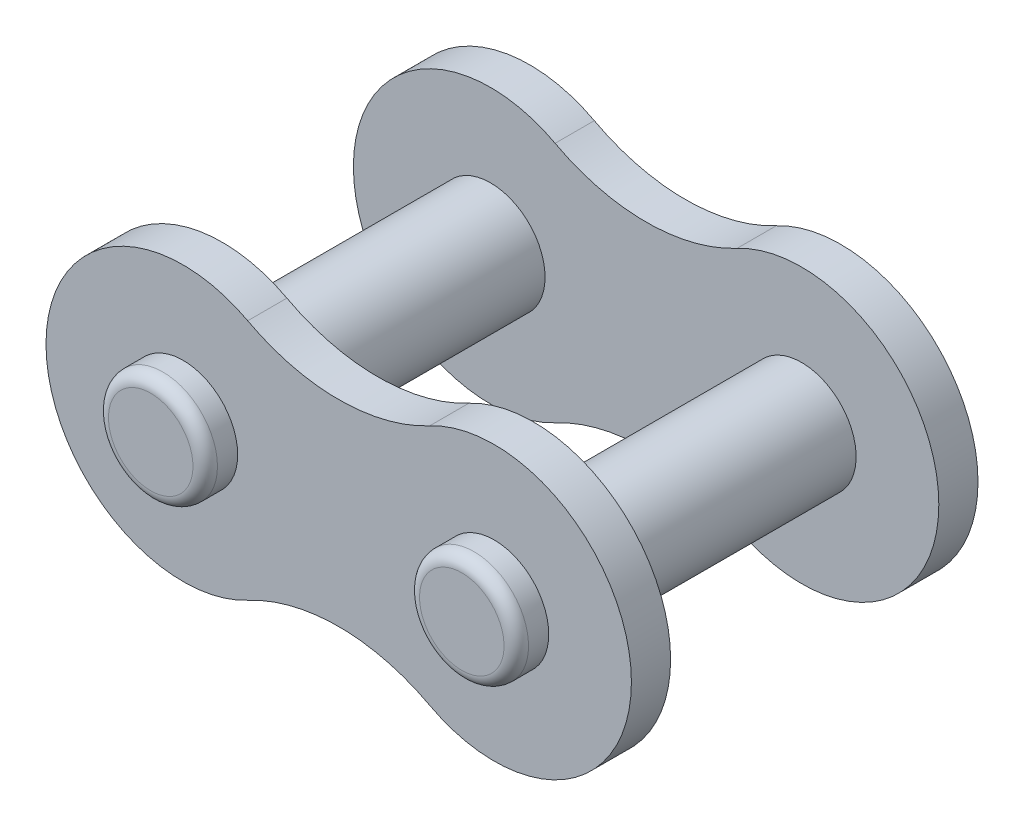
ISO-10303-21;
HEADER;
FILE_DESCRIPTION(('STEP AP214'),'2;1');
FILE_NAME('part.step','',(''),(''),'','','');
FILE_SCHEMA(('AUTOMOTIVE_DESIGN { 1 0 10303 214 1 1 1 1 }'));
ENDSEC;
DATA;
#1=APPLICATION_CONTEXT('core data for automotive mechanical design processes');
#2=APPLICATION_PROTOCOL_DEFINITION('international standard','automotive_design',2000,#1);
#3=PRODUCT_CONTEXT('',#1,'mechanical');
#4=PRODUCT('Part','Part','',(#3));
#5=PRODUCT_RELATED_PRODUCT_CATEGORY('part','',(#4));
#6=PRODUCT_DEFINITION_FORMATION('','',#4);
#7=PRODUCT_DEFINITION_CONTEXT('part definition',#1,'design');
#8=PRODUCT_DEFINITION('design','',#6,#7);
#9=PRODUCT_DEFINITION_SHAPE('','',#8);
#10=(LENGTH_UNIT() NAMED_UNIT(*) SI_UNIT(.MILLI.,.METRE.));
#11=(NAMED_UNIT(*) PLANE_ANGLE_UNIT() SI_UNIT($,.RADIAN.));
#12=(NAMED_UNIT(*) SI_UNIT($,.STERADIAN.) SOLID_ANGLE_UNIT());
#13=UNCERTAINTY_MEASURE_WITH_UNIT(LENGTH_MEASURE(1.E-05),#10,'distance_accuracy_value','');
#14=(GEOMETRIC_REPRESENTATION_CONTEXT(3) GLOBAL_UNCERTAINTY_ASSIGNED_CONTEXT((#13)) GLOBAL_UNIT_ASSIGNED_CONTEXT((#10,
#11,#12)) REPRESENTATION_CONTEXT('',''));
#15=CARTESIAN_POINT('',(0.,0.,0.));
#16=DIRECTION('',(0.,0.,1.));
#17=DIRECTION('',(1.,0.,0.));
#18=AXIS2_PLACEMENT_3D('',#15,#16,#17);
#19=CARTESIAN_POINT('',(0.,0.,-9.24000000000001));
#20=DIRECTION('',(0.,0.,-1.));
#21=DIRECTION('',(-1.,0.,0.));
#22=AXIS2_PLACEMENT_3D('',#19,#20,#21);
#23=CYLINDRICAL_SURFACE('',#22,2.225);
#24=CARTESIAN_POINT('',(0.,0.,-5.475));
#25=DIRECTION('',(0.,0.,-1.));
#26=DIRECTION('',(-1.,0.,0.));
#27=AXIS2_PLACEMENT_3D('',#24,#25,#26);
#28=CIRCLE('',#27,2.225);
#29=CARTESIAN_POINT('',(-2.225,0.,-5.475));
#30=VERTEX_POINT('',#29);
#31=EDGE_CURVE('E199',#30,#30,#28,.T.);
#32=ORIENTED_EDGE('',*,*,#31,.F.);
#33=EDGE_LOOP('',(#32));
#34=FACE_BOUND('',#33,.T.);
#35=CARTESIAN_POINT('',(0.,0.,5.475));
#36=DIRECTION('',(0.,0.,1.));
#37=DIRECTION('',(1.,0.,0.));
#38=AXIS2_PLACEMENT_3D('',#35,#36,#37);
#39=CIRCLE('',#38,2.225);
#40=CARTESIAN_POINT('',(2.225,0.,5.475));
#41=VERTEX_POINT('',#40);
#42=EDGE_CURVE('E11',#41,#41,#39,.T.);
#43=ORIENTED_EDGE('',*,*,#42,.F.);
#44=EDGE_LOOP('',(#43));
#45=FACE_BOUND('',#44,.T.);
#46=ADVANCED_FACE('F33',(#34,#45),#23,.T.);
#47=CARTESIAN_POINT('',(-12.7,0.,8.4));
#48=DIRECTION('',(0.,0.,1.));
#49=DIRECTION('',(1.,0.,0.));
#50=AXIS2_PLACEMENT_3D('',#47,#48,#49);
#51=CYLINDRICAL_SURFACE('',#50,2.225);
#52=CARTESIAN_POINT('',(-12.7,0.,-5.475));
#53=DIRECTION('',(0.,0.,-1.));
#54=DIRECTION('',(-1.,0.,0.));
#55=AXIS2_PLACEMENT_3D('',#52,#53,#54);
#56=CIRCLE('',#55,2.225);
#57=CARTESIAN_POINT('',(-14.925,0.,-5.475));
#58=VERTEX_POINT('',#57);
#59=EDGE_CURVE('E157',#58,#58,#56,.T.);
#60=ORIENTED_EDGE('',*,*,#59,.F.);
#61=EDGE_LOOP('',(#60));
#62=FACE_BOUND('',#61,.T.);
#63=CARTESIAN_POINT('',(-12.7,0.,5.475));
#64=DIRECTION('',(0.,0.,1.));
#65=DIRECTION('',(1.,0.,0.));
#66=AXIS2_PLACEMENT_3D('',#63,#64,#65);
#67=CIRCLE('',#66,2.225);
#68=CARTESIAN_POINT('',(-10.475,0.,5.475));
#69=VERTEX_POINT('',#68);
#70=EDGE_CURVE('E136',#69,#69,#67,.F.);
#71=ORIENTED_EDGE('',*,*,#70,.T.);
#72=EDGE_LOOP('',(#71));
#73=FACE_BOUND('',#72,.T.);
#74=ADVANCED_FACE('F204',(#62,#73),#51,.T.);
#75=CARTESIAN_POINT('',(0.,0.,-7.075));
#76=DIRECTION('',(0.,0.,-1.));
#77=DIRECTION('',(-1.,0.,0.));
#78=AXIS2_PLACEMENT_3D('',#75,#76,#77);
#79=CIRCLE('',#78,2.225);
#80=CARTESIAN_POINT('',(-2.225,0.,-7.075));
#81=VERTEX_POINT('',#80);
#82=EDGE_CURVE('E163',#81,#81,#79,.T.);
#83=ORIENTED_EDGE('',*,*,#82,.T.);
#84=EDGE_LOOP('',(#83));
#85=FACE_BOUND('',#84,.T.);
#86=CARTESIAN_POINT('',(0.,0.,-7.9));
#87=DIRECTION('',(0.,0.,-1.));
#88=DIRECTION('',(-1.,0.,0.));
#89=AXIS2_PLACEMENT_3D('',#86,#87,#88);
#90=CIRCLE('',#89,2.225);
#91=CARTESIAN_POINT('',(-2.225,0.,-7.9));
#92=VERTEX_POINT('',#91);
#93=EDGE_CURVE('E193',#92,#92,#90,.T.);
#94=ORIENTED_EDGE('',*,*,#93,.F.);
#95=EDGE_LOOP('',(#94));
#96=FACE_BOUND('',#95,.T.);
#97=ADVANCED_FACE('F214',(#85,#96),#23,.T.);
#98=CARTESIAN_POINT('',(0.,0.,-7.9));
#99=DIRECTION('',(0.,0.,-1.));
#100=DIRECTION('',(-1.,0.,0.));
#101=AXIS2_PLACEMENT_3D('',#98,#99,#100);
#102=TOROIDAL_SURFACE('',#101,1.725,0.5);
#103=CARTESIAN_POINT('',(0.,0.,-8.4));
#104=DIRECTION('',(0.,0.,-1.));
#105=DIRECTION('',(-1.,0.,0.));
#106=AXIS2_PLACEMENT_3D('',#103,#104,#105);
#107=CIRCLE('',#106,1.725);
#108=CARTESIAN_POINT('',(-1.725,0.,-8.4));
#109=VERTEX_POINT('',#108);
#110=EDGE_CURVE('E190',#109,#109,#107,.T.);
#111=ORIENTED_EDGE('',*,*,#110,.F.);
#112=EDGE_LOOP('',(#111));
#113=FACE_BOUND('',#112,.T.);
#114=ORIENTED_EDGE('',*,*,#93,.T.);
#115=EDGE_LOOP('',(#114));
#116=FACE_BOUND('',#115,.T.);
#117=ADVANCED_FACE('F227',(#113,#116),#102,.T.);
#118=CARTESIAN_POINT('',(0.,0.,-8.4));
#119=DIRECTION('',(0.,0.,1.));
#120=DIRECTION('',(1.,0.,0.));
#121=AXIS2_PLACEMENT_3D('',#118,#119,#120);
#122=PLANE('',#121);
#123=ORIENTED_EDGE('',*,*,#110,.T.);
#124=EDGE_LOOP('',(#123));
#125=FACE_BOUND('',#124,.T.);
#126=ADVANCED_FACE('F232',(#125),#122,.F.);
#127=CARTESIAN_POINT('',(-3.175,-5.95326666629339,-7.075));
#128=DIRECTION('',(0.,0.,-1.));
#129=DIRECTION('',(-1.,0.,0.));
#130=AXIS2_PLACEMENT_3D('',#127,#128,#129);
#131=PLANE('',#130);
#132=ORIENTED_EDGE('',*,*,#82,.F.);
#133=EDGE_LOOP('',(#132));
#134=FACE_BOUND('',#133,.T.);
#135=CARTESIAN_POINT('',(-6.35,-11.9065333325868,-7.075));
#136=DIRECTION('',(0.,0.,1.));
#137=DIRECTION('',(-1.,0.,0.));
#138=AXIS2_PLACEMENT_3D('',#135,#136,#137);
#139=CIRCLE('',#138,7.894);
#140=CARTESIAN_POINT('',(-2.63524529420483,-4.9412025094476,-7.075));
#141=VERTEX_POINT('',#140);
#142=CARTESIAN_POINT('',(-10.0647547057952,-4.9412025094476,-7.075));
#143=VERTEX_POINT('',#142);
#144=EDGE_CURVE('E167',#141,#143,#139,.T.);
#145=ORIENTED_EDGE('',*,*,#144,.T.);
#146=CARTESIAN_POINT('',(-12.7,0.,-7.075));
#147=DIRECTION('',(0.,0.,-1.));
#148=DIRECTION('',(-1.,0.,0.));
#149=AXIS2_PLACEMENT_3D('',#146,#147,#148);
#150=CIRCLE('',#149,5.6);
#151=CARTESIAN_POINT('',(-10.0647547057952,4.9412025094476,-7.075));
#152=VERTEX_POINT('',#151);
#153=EDGE_CURVE('E83',#143,#152,#150,.T.);
#154=ORIENTED_EDGE('',*,*,#153,.T.);
#155=CARTESIAN_POINT('',(-6.35,11.9065333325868,-7.075));
#156=DIRECTION('',(0.,0.,1.));
#157=DIRECTION('',(1.,0.,0.));
#158=AXIS2_PLACEMENT_3D('',#155,#156,#157);
#159=CIRCLE('',#158,7.894);
#160=CARTESIAN_POINT('',(-2.63524529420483,4.9412025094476,-7.075));
#161=VERTEX_POINT('',#160);
#162=EDGE_CURVE('E170',#152,#161,#159,.T.);
#163=ORIENTED_EDGE('',*,*,#162,.T.);
#164=CARTESIAN_POINT('',(0.,0.,-7.075));
#165=DIRECTION('',(0.,0.,-1.));
#166=DIRECTION('',(-1.,0.,0.));
#167=AXIS2_PLACEMENT_3D('',#164,#165,#166);
#168=CIRCLE('',#167,5.6);
#169=EDGE_CURVE('E51',#161,#141,#168,.T.);
#170=ORIENTED_EDGE('',*,*,#169,.T.);
#171=EDGE_LOOP('',(#145,#154,#163,#170));
#172=FACE_BOUND('',#171,.T.);
#173=CARTESIAN_POINT('',(-12.7,0.,-7.075));
#174=DIRECTION('',(0.,0.,-1.));
#175=DIRECTION('',(-1.,0.,0.));
#176=AXIS2_PLACEMENT_3D('',#173,#174,#175);
#177=CIRCLE('',#176,2.225);
#178=CARTESIAN_POINT('',(-14.925,0.,-7.075));
#179=VERTEX_POINT('',#178);
#180=EDGE_CURVE('E160',#179,#179,#177,.T.);
#181=ORIENTED_EDGE('',*,*,#180,.F.);
#182=EDGE_LOOP('',(#181));
#183=FACE_BOUND('',#182,.T.);
#184=ADVANCED_FACE('F239',(#134,#172,#183),#131,.T.);
#185=CARTESIAN_POINT('',(-3.175,-5.95326666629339,-5.475));
#186=DIRECTION('',(0.,0.,-1.));
#187=DIRECTION('',(-1.,0.,0.));
#188=AXIS2_PLACEMENT_3D('',#185,#186,#187);
#189=PLANE('',#188);
#190=CARTESIAN_POINT('',(-6.35,-11.9065333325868,-5.475));
#191=DIRECTION('',(0.,0.,1.));
#192=DIRECTION('',(-1.,0.,0.));
#193=AXIS2_PLACEMENT_3D('',#190,#191,#192);
#194=CIRCLE('',#193,7.894);
#195=CARTESIAN_POINT('',(-2.63524529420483,-4.9412025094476,-5.475));
#196=VERTEX_POINT('',#195);
#197=CARTESIAN_POINT('',(-10.0647547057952,-4.9412025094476,-5.475));
#198=VERTEX_POINT('',#197);
#199=EDGE_CURVE('E166',#196,#198,#194,.T.);
#200=ORIENTED_EDGE('',*,*,#199,.F.);
#201=CARTESIAN_POINT('',(0.,0.,-5.475));
#202=DIRECTION('',(0.,0.,-1.));
#203=DIRECTION('',(-1.,0.,0.));
#204=AXIS2_PLACEMENT_3D('',#201,#202,#203);
#205=CIRCLE('',#204,5.6);
#206=CARTESIAN_POINT('',(-2.63524529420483,4.9412025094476,-5.475));
#207=VERTEX_POINT('',#206);
#208=EDGE_CURVE('E75',#207,#196,#205,.T.);
#209=ORIENTED_EDGE('',*,*,#208,.F.);
#210=CARTESIAN_POINT('',(-6.35,11.9065333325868,-5.475));
#211=DIRECTION('',(0.,0.,1.));
#212=DIRECTION('',(1.,0.,0.));
#213=AXIS2_PLACEMENT_3D('',#210,#211,#212);
#214=CIRCLE('',#213,7.894);
#215=CARTESIAN_POINT('',(-10.0647547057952,4.9412025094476,-5.475));
#216=VERTEX_POINT('',#215);
#217=EDGE_CURVE('E69',#216,#207,#214,.T.);
#218=ORIENTED_EDGE('',*,*,#217,.F.);
#219=CARTESIAN_POINT('',(-12.7,0.,-5.475));
#220=DIRECTION('',(0.,0.,-1.));
#221=DIRECTION('',(-1.,0.,0.));
#222=AXIS2_PLACEMENT_3D('',#219,#220,#221);
#223=CIRCLE('',#222,5.6);
#224=EDGE_CURVE('E176',#198,#216,#223,.T.);
#225=ORIENTED_EDGE('',*,*,#224,.F.);
#226=EDGE_LOOP('',(#200,#209,#218,#225));
#227=FACE_BOUND('',#226,.T.);
#228=ORIENTED_EDGE('',*,*,#31,.T.);
#229=EDGE_LOOP('',(#228));
#230=FACE_BOUND('',#229,.T.);
#231=ORIENTED_EDGE('',*,*,#59,.T.);
#232=EDGE_LOOP('',(#231));
#233=FACE_BOUND('',#232,.T.);
#234=ADVANCED_FACE('F241',(#227,#230,#233),#189,.F.);
#235=CARTESIAN_POINT('',(-6.35,-11.9065333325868,-7.075));
#236=DIRECTION('',(0.,0.,1.));
#237=DIRECTION('',(1.,0.,0.));
#238=AXIS2_PLACEMENT_3D('',#235,#236,#237);
#239=CYLINDRICAL_SURFACE('',#238,7.894);
#240=ORIENTED_EDGE('',*,*,#199,.T.);
#241=DIRECTION('',(0.,0.,1.));
#242=VECTOR('',#241,1.);
#243=CARTESIAN_POINT('',(-10.0647547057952,-4.9412025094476,-7.075));
#244=LINE('',#243,#242);
#245=EDGE_CURVE('E185',#143,#198,#244,.T.);
#246=ORIENTED_EDGE('',*,*,#245,.F.);
#247=ORIENTED_EDGE('',*,*,#144,.F.);
#248=DIRECTION('',(0.,0.,1.));
#249=VECTOR('',#248,1.);
#250=CARTESIAN_POINT('',(-2.63524529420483,-4.9412025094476,-7.075));
#251=LINE('',#250,#249);
#252=EDGE_CURVE('E173',#141,#196,#251,.T.);
#253=ORIENTED_EDGE('',*,*,#252,.T.);
#254=EDGE_LOOP('',(#240,#246,#247,#253));
#255=FACE_BOUND('',#254,.T.);
#256=ADVANCED_FACE('F275',(#255),#239,.F.);
#257=CARTESIAN_POINT('',(-12.7,0.,-7.075));
#258=DIRECTION('',(0.,0.,1.));
#259=DIRECTION('',(1.,0.,0.));
#260=AXIS2_PLACEMENT_3D('',#257,#258,#259);
#261=CYLINDRICAL_SURFACE('',#260,5.6);
#262=ORIENTED_EDGE('',*,*,#224,.T.);
#263=DIRECTION('',(0.,0.,1.));
#264=VECTOR('',#263,1.);
#265=CARTESIAN_POINT('',(-10.0647547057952,4.9412025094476,-7.075));
#266=LINE('',#265,#264);
#267=EDGE_CURVE('E183',#152,#216,#266,.T.);
#268=ORIENTED_EDGE('',*,*,#267,.F.);
#269=ORIENTED_EDGE('',*,*,#153,.F.);
#270=ORIENTED_EDGE('',*,*,#245,.T.);
#271=EDGE_LOOP('',(#262,#268,#269,#270));
#272=FACE_BOUND('',#271,.T.);
#273=ADVANCED_FACE('F282',(#272),#261,.T.);
#274=CARTESIAN_POINT('',(-6.35,11.9065333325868,-7.075));
#275=DIRECTION('',(0.,0.,1.));
#276=DIRECTION('',(1.,0.,0.));
#277=AXIS2_PLACEMENT_3D('',#274,#275,#276);
#278=CYLINDRICAL_SURFACE('',#277,7.894);
#279=ORIENTED_EDGE('',*,*,#217,.T.);
#280=DIRECTION('',(0.,0.,1.));
#281=VECTOR('',#280,1.);
#282=CARTESIAN_POINT('',(-2.63524529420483,4.9412025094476,-7.075));
#283=LINE('',#282,#281);
#284=EDGE_CURVE('E181',#161,#207,#283,.T.);
#285=ORIENTED_EDGE('',*,*,#284,.F.);
#286=ORIENTED_EDGE('',*,*,#162,.F.);
#287=ORIENTED_EDGE('',*,*,#267,.T.);
#288=EDGE_LOOP('',(#279,#285,#286,#287));
#289=FACE_BOUND('',#288,.T.);
#290=ADVANCED_FACE('F279',(#289),#278,.F.);
#291=CARTESIAN_POINT('',(0.,0.,-7.075));
#292=DIRECTION('',(0.,0.,1.));
#293=DIRECTION('',(1.,0.,0.));
#294=AXIS2_PLACEMENT_3D('',#291,#292,#293);
#295=CYLINDRICAL_SURFACE('',#294,5.6);
#296=ORIENTED_EDGE('',*,*,#208,.T.);
#297=ORIENTED_EDGE('',*,*,#252,.F.);
#298=ORIENTED_EDGE('',*,*,#169,.F.);
#299=ORIENTED_EDGE('',*,*,#284,.T.);
#300=EDGE_LOOP('',(#296,#297,#298,#299));
#301=FACE_BOUND('',#300,.T.);
#302=ADVANCED_FACE('F260',(#301),#295,.T.);
#303=CARTESIAN_POINT('',(-14.425,0.,-8.4));
#304=DIRECTION('',(0.,0.,-1.));
#305=DIRECTION('',(-1.,0.,0.));
#306=AXIS2_PLACEMENT_3D('',#303,#304,#305);
#307=PLANE('',#306);
#308=CARTESIAN_POINT('',(-12.7,0.,-8.4));
#309=DIRECTION('',(0.,0.,1.));
#310=DIRECTION('',(1.,0.,0.));
#311=AXIS2_PLACEMENT_3D('',#308,#309,#310);
#312=CIRCLE('',#311,1.725);
#313=CARTESIAN_POINT('',(-10.975,0.,-8.4));
#314=VERTEX_POINT('',#313);
#315=EDGE_CURVE('E151',#314,#314,#312,.T.);
#316=ORIENTED_EDGE('',*,*,#315,.F.);
#317=EDGE_LOOP('',(#316));
#318=FACE_BOUND('',#317,.T.);
#319=ADVANCED_FACE('F254',(#318),#307,.T.);
#320=CARTESIAN_POINT('',(-12.7,0.,-7.9));
#321=DIRECTION('',(0.,0.,1.));
#322=DIRECTION('',(1.,0.,0.));
#323=AXIS2_PLACEMENT_3D('',#320,#321,#322);
#324=TOROIDAL_SURFACE('',#323,1.725,0.5);
#325=ORIENTED_EDGE('',*,*,#315,.T.);
#326=EDGE_LOOP('',(#325));
#327=FACE_BOUND('',#326,.T.);
#328=CARTESIAN_POINT('',(-12.7,0.,-7.9));
#329=DIRECTION('',(0.,0.,1.));
#330=DIRECTION('',(1.,0.,0.));
#331=AXIS2_PLACEMENT_3D('',#328,#329,#330);
#332=CIRCLE('',#331,2.225);
#333=CARTESIAN_POINT('',(-10.475,0.,-7.9));
#334=VERTEX_POINT('',#333);
#335=EDGE_CURVE('E148',#334,#334,#332,.T.);
#336=ORIENTED_EDGE('',*,*,#335,.F.);
#337=EDGE_LOOP('',(#336));
#338=FACE_BOUND('',#337,.T.);
#339=ADVANCED_FACE('F250',(#327,#338),#324,.T.);
#340=ORIENTED_EDGE('',*,*,#180,.T.);
#341=EDGE_LOOP('',(#340));
#342=FACE_BOUND('',#341,.T.);
#343=ORIENTED_EDGE('',*,*,#335,.T.);
#344=EDGE_LOOP('',(#343));
#345=FACE_BOUND('',#344,.T.);
#346=ADVANCED_FACE('F221',(#342,#345),#51,.T.);
#347=CARTESIAN_POINT('',(-3.175,-5.95326666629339,7.075));
#348=DIRECTION('',(0.,0.,1.));
#349=DIRECTION('',(-1.,0.,0.));
#350=AXIS2_PLACEMENT_3D('',#347,#348,#349);
#351=PLANE('',#350);
#352=CARTESIAN_POINT('',(-12.7,0.,7.075));
#353=DIRECTION('',(0.,0.,1.));
#354=DIRECTION('',(1.,0.,0.));
#355=AXIS2_PLACEMENT_3D('',#352,#353,#354);
#356=CIRCLE('',#355,2.225);
#357=CARTESIAN_POINT('',(-10.475,0.,7.075));
#358=VERTEX_POINT('',#357);
#359=EDGE_CURVE('E37',#358,#358,#356,.F.);
#360=ORIENTED_EDGE('',*,*,#359,.T.);
#361=EDGE_LOOP('',(#360));
#362=FACE_BOUND('',#361,.T.);
#363=CARTESIAN_POINT('',(-6.35,-11.9065333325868,7.075));
#364=DIRECTION('',(0.,0.,1.));
#365=DIRECTION('',(-1.,0.,0.));
#366=AXIS2_PLACEMENT_3D('',#363,#364,#365);
#367=CIRCLE('',#366,7.894);
#368=CARTESIAN_POINT('',(-2.63524529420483,-4.9412025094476,7.075));
#369=VERTEX_POINT('',#368);
#370=CARTESIAN_POINT('',(-10.0647547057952,-4.9412025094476,7.075));
#371=VERTEX_POINT('',#370);
#372=EDGE_CURVE('E134',#369,#371,#367,.T.);
#373=ORIENTED_EDGE('',*,*,#372,.F.);
#374=CARTESIAN_POINT('',(0.,0.,7.075));
#375=DIRECTION('',(0.,0.,-1.));
#376=DIRECTION('',(-1.,0.,0.));
#377=AXIS2_PLACEMENT_3D('',#374,#375,#376);
#378=CIRCLE('',#377,5.6);
#379=CARTESIAN_POINT('',(-2.63524529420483,4.9412025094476,7.075));
#380=VERTEX_POINT('',#379);
#381=EDGE_CURVE('E116',#380,#369,#378,.T.);
#382=ORIENTED_EDGE('',*,*,#381,.F.);
#383=CARTESIAN_POINT('',(-6.35,11.9065333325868,7.075));
#384=DIRECTION('',(0.,0.,1.));
#385=DIRECTION('',(1.,0.,0.));
#386=AXIS2_PLACEMENT_3D('',#383,#384,#385);
#387=CIRCLE('',#386,7.894);
#388=CARTESIAN_POINT('',(-10.0647547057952,4.9412025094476,7.075));
#389=VERTEX_POINT('',#388);
#390=EDGE_CURVE('E468',#389,#380,#387,.T.);
#391=ORIENTED_EDGE('',*,*,#390,.F.);
#392=CARTESIAN_POINT('',(-12.7,0.,7.075));
#393=DIRECTION('',(0.,0.,-1.));
#394=DIRECTION('',(-1.,0.,0.));
#395=AXIS2_PLACEMENT_3D('',#392,#393,#394);
#396=CIRCLE('',#395,5.6);
#397=EDGE_CURVE('E138',#371,#389,#396,.T.);
#398=ORIENTED_EDGE('',*,*,#397,.F.);
#399=EDGE_LOOP('',(#373,#382,#391,#398));
#400=FACE_BOUND('',#399,.T.);
#401=CARTESIAN_POINT('',(0.,0.,7.075));
#402=DIRECTION('',(0.,0.,1.));
#403=DIRECTION('',(1.,0.,0.));
#404=AXIS2_PLACEMENT_3D('',#401,#402,#403);
#405=CIRCLE('',#404,2.225);
#406=CARTESIAN_POINT('',(2.225,0.,7.075));
#407=VERTEX_POINT('',#406);
#408=EDGE_CURVE('E142',#407,#407,#405,.T.);
#409=ORIENTED_EDGE('',*,*,#408,.F.);
#410=EDGE_LOOP('',(#409));
#411=FACE_BOUND('',#410,.T.);
#412=ADVANCED_FACE('F207',(#362,#400,#411),#351,.T.);
#413=CARTESIAN_POINT('',(-3.175,-5.95326666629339,5.475));
#414=DIRECTION('',(0.,0.,1.));
#415=DIRECTION('',(-1.,0.,0.));
#416=AXIS2_PLACEMENT_3D('',#413,#414,#415);
#417=PLANE('',#416);
#418=CARTESIAN_POINT('',(-6.35,-11.9065333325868,5.475));
#419=DIRECTION('',(0.,0.,1.));
#420=DIRECTION('',(-1.,0.,0.));
#421=AXIS2_PLACEMENT_3D('',#418,#419,#420);
#422=CIRCLE('',#421,7.894);
#423=CARTESIAN_POINT('',(-2.63524529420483,-4.9412025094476,5.475));
#424=VERTEX_POINT('',#423);
#425=CARTESIAN_POINT('',(-10.0647547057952,-4.9412025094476,5.475));
#426=VERTEX_POINT('',#425);
#427=EDGE_CURVE('E127',#424,#426,#422,.T.);
#428=ORIENTED_EDGE('',*,*,#427,.T.);
#429=CARTESIAN_POINT('',(-12.7,0.,5.475));
#430=DIRECTION('',(0.,0.,-1.));
#431=DIRECTION('',(-1.,0.,0.));
#432=AXIS2_PLACEMENT_3D('',#429,#430,#431);
#433=CIRCLE('',#432,5.6);
#434=CARTESIAN_POINT('',(-10.0647547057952,4.9412025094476,5.475));
#435=VERTEX_POINT('',#434);
#436=EDGE_CURVE('E469',#426,#435,#433,.T.);
#437=ORIENTED_EDGE('',*,*,#436,.T.);
#438=CARTESIAN_POINT('',(-6.35,11.9065333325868,5.475));
#439=DIRECTION('',(0.,0.,1.));
#440=DIRECTION('',(1.,0.,0.));
#441=AXIS2_PLACEMENT_3D('',#438,#439,#440);
#442=CIRCLE('',#441,7.894);
#443=CARTESIAN_POINT('',(-2.63524529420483,4.9412025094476,5.475));
#444=VERTEX_POINT('',#443);
#445=EDGE_CURVE('E129',#435,#444,#442,.T.);
#446=ORIENTED_EDGE('',*,*,#445,.T.);
#447=CARTESIAN_POINT('',(0.,0.,5.475));
#448=DIRECTION('',(0.,0.,-1.));
#449=DIRECTION('',(-1.,0.,0.));
#450=AXIS2_PLACEMENT_3D('',#447,#448,#449);
#451=CIRCLE('',#450,5.6);
#452=EDGE_CURVE('E113',#444,#424,#451,.T.);
#453=ORIENTED_EDGE('',*,*,#452,.T.);
#454=EDGE_LOOP('',(#428,#437,#446,#453));
#455=FACE_BOUND('',#454,.T.);
#456=ORIENTED_EDGE('',*,*,#70,.F.);
#457=EDGE_LOOP('',(#456));
#458=FACE_BOUND('',#457,.T.);
#459=ORIENTED_EDGE('',*,*,#42,.T.);
#460=EDGE_LOOP('',(#459));
#461=FACE_BOUND('',#460,.T.);
#462=ADVANCED_FACE('F124',(#455,#458,#461),#417,.F.);
#463=CARTESIAN_POINT('',(-6.35,-11.9065333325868,7.075));
#464=DIRECTION('',(0.,0.,-1.));
#465=DIRECTION('',(1.,0.,0.));
#466=AXIS2_PLACEMENT_3D('',#463,#464,#465);
#467=CYLINDRICAL_SURFACE('',#466,7.894);
#468=ORIENTED_EDGE('',*,*,#427,.F.);
#469=DIRECTION('',(0.,0.,-1.));
#470=VECTOR('',#469,1.);
#471=CARTESIAN_POINT('',(-2.63524529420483,-4.9412025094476,7.075));
#472=LINE('',#471,#470);
#473=EDGE_CURVE('E110',#369,#424,#472,.T.);
#474=ORIENTED_EDGE('',*,*,#473,.F.);
#475=ORIENTED_EDGE('',*,*,#372,.T.);
#476=DIRECTION('',(0.,0.,-1.));
#477=VECTOR('',#476,1.);
#478=CARTESIAN_POINT('',(-10.0647547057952,-4.9412025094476,7.075));
#479=LINE('',#478,#477);
#480=EDGE_CURVE('E132',#371,#426,#479,.T.);
#481=ORIENTED_EDGE('',*,*,#480,.T.);
#482=EDGE_LOOP('',(#468,#474,#475,#481));
#483=FACE_BOUND('',#482,.T.);
#484=ADVANCED_FACE('F131',(#483),#467,.F.);
#485=CARTESIAN_POINT('',(-12.7,0.,7.075));
#486=DIRECTION('',(0.,0.,-1.));
#487=DIRECTION('',(1.,0.,0.));
#488=AXIS2_PLACEMENT_3D('',#485,#486,#487);
#489=CYLINDRICAL_SURFACE('',#488,5.6);
#490=ORIENTED_EDGE('',*,*,#436,.F.);
#491=ORIENTED_EDGE('',*,*,#480,.F.);
#492=ORIENTED_EDGE('',*,*,#397,.T.);
#493=DIRECTION('',(0.,0.,-1.));
#494=VECTOR('',#493,1.);
#495=CARTESIAN_POINT('',(-10.0647547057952,4.9412025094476,7.075));
#496=LINE('',#495,#494);
#497=EDGE_CURVE('E470',#389,#435,#496,.T.);
#498=ORIENTED_EDGE('',*,*,#497,.T.);
#499=EDGE_LOOP('',(#490,#491,#492,#498));
#500=FACE_BOUND('',#499,.T.);
#501=ADVANCED_FACE('F376',(#500),#489,.T.);
#502=CARTESIAN_POINT('',(-6.35,11.9065333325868,7.075));
#503=DIRECTION('',(0.,0.,-1.));
#504=DIRECTION('',(1.,0.,0.));
#505=AXIS2_PLACEMENT_3D('',#502,#503,#504);
#506=CYLINDRICAL_SURFACE('',#505,7.894);
#507=ORIENTED_EDGE('',*,*,#445,.F.);
#508=ORIENTED_EDGE('',*,*,#497,.F.);
#509=ORIENTED_EDGE('',*,*,#390,.T.);
#510=DIRECTION('',(0.,0.,-1.));
#511=VECTOR('',#510,1.);
#512=CARTESIAN_POINT('',(-2.63524529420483,4.9412025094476,7.075));
#513=LINE('',#512,#511);
#514=EDGE_CURVE('E476',#380,#444,#513,.T.);
#515=ORIENTED_EDGE('',*,*,#514,.T.);
#516=EDGE_LOOP('',(#507,#508,#509,#515));
#517=FACE_BOUND('',#516,.T.);
#518=ADVANCED_FACE('F385',(#517),#506,.F.);
#519=CARTESIAN_POINT('',(0.,0.,7.075));
#520=DIRECTION('',(0.,0.,-1.));
#521=DIRECTION('',(1.,0.,0.));
#522=AXIS2_PLACEMENT_3D('',#519,#520,#521);
#523=CYLINDRICAL_SURFACE('',#522,5.6);
#524=ORIENTED_EDGE('',*,*,#452,.F.);
#525=ORIENTED_EDGE('',*,*,#514,.F.);
#526=ORIENTED_EDGE('',*,*,#381,.T.);
#527=ORIENTED_EDGE('',*,*,#473,.T.);
#528=EDGE_LOOP('',(#524,#525,#526,#527));
#529=FACE_BOUND('',#528,.T.);
#530=ADVANCED_FACE('F112',(#529),#523,.T.);
#531=CARTESIAN_POINT('',(-12.7,0.,8.4));
#532=DIRECTION('',(0.,0.,1.));
#533=DIRECTION('',(1.,0.,0.));
#534=AXIS2_PLACEMENT_3D('',#531,#532,#533);
#535=PLANE('',#534);
#536=CARTESIAN_POINT('',(-12.7,0.,8.4));
#537=DIRECTION('',(0.,0.,1.));
#538=DIRECTION('',(1.,0.,0.));
#539=AXIS2_PLACEMENT_3D('',#536,#537,#538);
#540=CIRCLE('',#539,1.725);
#541=CARTESIAN_POINT('',(-10.975,0.,8.4));
#542=VERTEX_POINT('',#541);
#543=EDGE_CURVE('E154',#542,#542,#540,.T.);
#544=ORIENTED_EDGE('',*,*,#543,.T.);
#545=EDGE_LOOP('',(#544));
#546=FACE_BOUND('',#545,.T.);
#547=ADVANCED_FACE('F265',(#546),#535,.T.);
#548=CARTESIAN_POINT('',(-12.7,0.,7.9));
#549=DIRECTION('',(0.,0.,1.));
#550=DIRECTION('',(1.,0.,0.));
#551=AXIS2_PLACEMENT_3D('',#548,#549,#550);
#552=TOROIDAL_SURFACE('',#551,1.725,0.5);
#553=CARTESIAN_POINT('',(-12.7,0.,7.9));
#554=DIRECTION('',(0.,0.,1.));
#555=DIRECTION('',(1.,0.,0.));
#556=AXIS2_PLACEMENT_3D('',#553,#554,#555);
#557=CIRCLE('',#556,2.225);
#558=CARTESIAN_POINT('',(-10.475,0.,7.9));
#559=VERTEX_POINT('',#558);
#560=EDGE_CURVE('E145',#559,#559,#557,.T.);
#561=ORIENTED_EDGE('',*,*,#560,.T.);
#562=EDGE_LOOP('',(#561));
#563=FACE_BOUND('',#562,.T.);
#564=ORIENTED_EDGE('',*,*,#543,.F.);
#565=EDGE_LOOP('',(#564));
#566=FACE_BOUND('',#565,.T.);
#567=ADVANCED_FACE('F268',(#563,#566),#552,.T.);
#568=ORIENTED_EDGE('',*,*,#359,.F.);
#569=EDGE_LOOP('',(#568));
#570=FACE_BOUND('',#569,.T.);
#571=ORIENTED_EDGE('',*,*,#560,.F.);
#572=EDGE_LOOP('',(#571));
#573=FACE_BOUND('',#572,.T.);
#574=ADVANCED_FACE('F220',(#570,#573),#51,.T.);
#575=CARTESIAN_POINT('',(1.725,0.,8.4));
#576=DIRECTION('',(0.,0.,-1.));
#577=DIRECTION('',(-1.,0.,0.));
#578=AXIS2_PLACEMENT_3D('',#575,#576,#577);
#579=PLANE('',#578);
#580=CARTESIAN_POINT('',(0.,0.,8.4));
#581=DIRECTION('',(0.,0.,-1.));
#582=DIRECTION('',(-1.,0.,0.));
#583=AXIS2_PLACEMENT_3D('',#580,#581,#582);
#584=CIRCLE('',#583,1.725);
#585=CARTESIAN_POINT('',(-1.725,0.,8.4));
#586=VERTEX_POINT('',#585);
#587=EDGE_CURVE('E187',#586,#586,#584,.T.);
#588=ORIENTED_EDGE('',*,*,#587,.F.);
#589=EDGE_LOOP('',(#588));
#590=FACE_BOUND('',#589,.T.);
#591=ADVANCED_FACE('F288',(#590),#579,.F.);
#592=CARTESIAN_POINT('',(0.,0.,7.9));
#593=DIRECTION('',(0.,0.,-1.));
#594=DIRECTION('',(-1.,0.,0.));
#595=AXIS2_PLACEMENT_3D('',#592,#593,#594);
#596=TOROIDAL_SURFACE('',#595,1.725,0.5);
#597=CARTESIAN_POINT('',(0.,0.,7.9));
#598=DIRECTION('',(0.,0.,-1.));
#599=DIRECTION('',(-1.,0.,0.));
#600=AXIS2_PLACEMENT_3D('',#597,#598,#599);
#601=CIRCLE('',#600,2.225);
#602=CARTESIAN_POINT('',(-2.225,0.,7.9));
#603=VERTEX_POINT('',#602);
#604=EDGE_CURVE('E196',#603,#603,#601,.T.);
#605=ORIENTED_EDGE('',*,*,#604,.F.);
#606=EDGE_LOOP('',(#605));
#607=FACE_BOUND('',#606,.T.);
#608=ORIENTED_EDGE('',*,*,#587,.T.);
#609=EDGE_LOOP('',(#608));
#610=FACE_BOUND('',#609,.T.);
#611=ADVANCED_FACE('F35',(#607,#610),#596,.T.);
#612=ORIENTED_EDGE('',*,*,#408,.T.);
#613=EDGE_LOOP('',(#612));
#614=FACE_BOUND('',#613,.T.);
#615=ORIENTED_EDGE('',*,*,#604,.T.);
#616=EDGE_LOOP('',(#615));
#617=FACE_BOUND('',#616,.T.);
#618=ADVANCED_FACE('F213',(#614,#617),#23,.T.);
#619=CLOSED_SHELL('',(#46,#74,#97,#117,#126,#184,#234,#256,#273,#290,#302,#319,#339,#346,#412,
#462,#484,#501,#518,#530,#547,#567,#574,#591,#611,#618));
#620=MANIFOLD_SOLID_BREP('B2',#619);
#621=ADVANCED_BREP_SHAPE_REPRESENTATION('',(#18,#620),#14);
#622=SHAPE_DEFINITION_REPRESENTATION(#9,#621);
ENDSEC;
END-ISO-10303-21;
